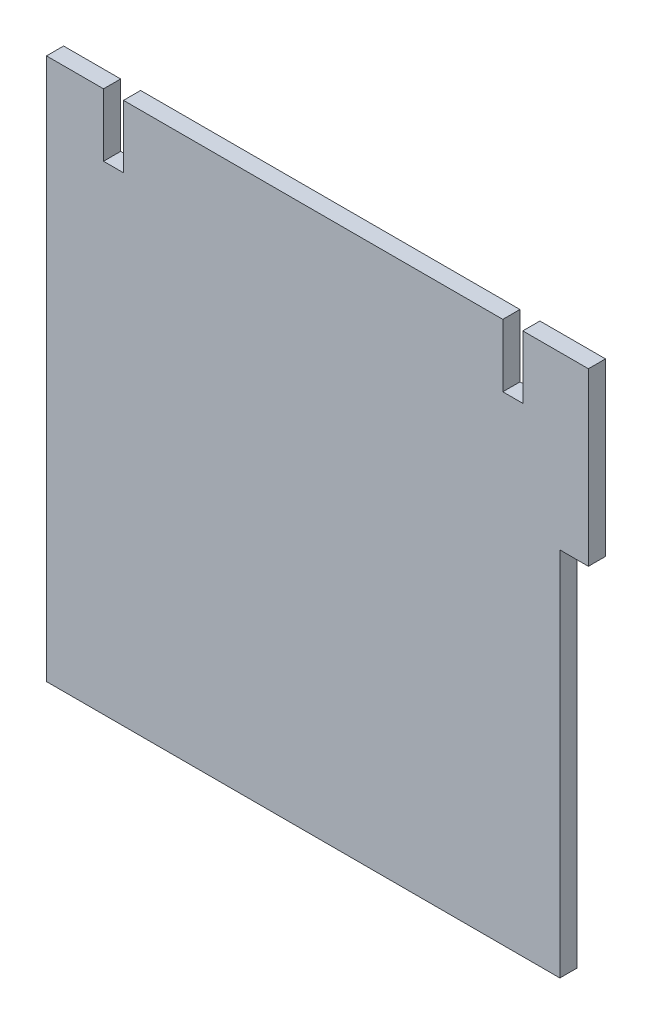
from build123d import *

# Parameters (mm, degrees)
ESQUISSE1_W             = 95
ESQUISSE1_H             = 95
EXTRUSION1_DEPTH        = 3
ESQUISSE2_W             = 3.5
ESQUISSE2_H             = 11
ESQUISSE2_W_2           = 5
ESQUISSE2_H_2           = 65
ENL_V_MAT_EXTRU_1_DEPTH = 3


with BuildPart() as part:
    # Esquisse1 → Extrusion1 (new body)
    with BuildSketch(Plane.XY):
        with Locations((47.5, 47.5)):
            Rectangle(ESQUISSE1_W, ESQUISSE1_H)
    extrude(amount=EXTRUSION1_DEPTH)

    # Esquisse2 → Enl_v. mat.-Extru.1 (cut)
    with BuildSketch(Plane.XY.offset(3)):
        with Locations((11.75, 89.5)):
            Rectangle(ESQUISSE2_W, ESQUISSE2_H)
        with Locations((81.75, 89.5)):
            Rectangle(ESQUISSE2_W, ESQUISSE2_H)
        with Locations((92.5, 32.5)):
            Rectangle(ESQUISSE2_W_2, ESQUISSE2_H_2)
    extrude(amount=-ENL_V_MAT_EXTRU_1_DEPTH, mode=Mode.SUBTRACT)


solid = part.part
